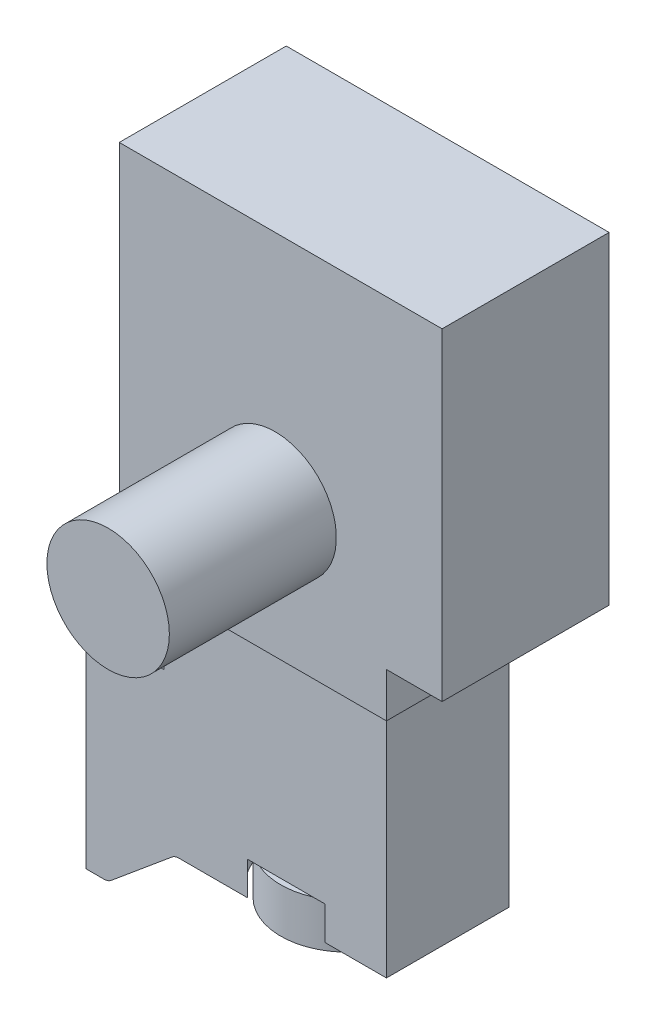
from build123d import *

# Parameters (mm, degrees)
BASE_EXTRUSION_DEPTH    = 5.5
ESQUISSE2_W             = 20
ESQUISSE2_H             = 11
BOSS_EXTRU_1_DEPTH      = 8
ESQUISSE3_W             = 24
ESQUISSE3_H             = 15
BOSS_EXTRU_2_DEPTH      = 4
ESQUISSE4_W             = 29
ESQUISSE4_H             = 15
BOSS_EXTRU_3_DEPTH      = 29
ESQUISSE5_R             = 5.5
BOSS_EXTRU_4_DEPTH      = 15
ESQUISSE6_R             = 6.5
ENL_V_MAT_EXTRU_1_DEPTH = 3
ESQUISSE7_R             = 6
BOSS_EXTRU_5_DEPTH      = 4


with BuildPart() as part:
    # Esquisse1 → Base-Extrusion (new, symmetric)
    with BuildSketch(Plane.XY):
        with BuildLine():
            Line((2.278134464, 0.23177872), (7.721865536, 4.76822128))
            ThreePointArc((7.721865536, 4.76822128), (8.021624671, 4.940271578), (8.362049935, 5))
            Line((8.362049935, 5), (27, 5))
            Line((27, 5), (27, 19))
            Line((27, 19), (0, 19))
            Line((0, 19), (0, 0))
            Line((0, 0), (1.637950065, 0))
            ThreePointArc((1.637950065, 0), (1.978375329, 0.059728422), (2.278134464, 0.23177872))
        make_face()
    extrude(amount=BASE_EXTRUSION_DEPTH, both=True)

    # Esquisse2 → Boss.-Extru.1 (add)
    with BuildSketch(Plane(origin=(0, 19, 0), x_dir=(-1, 0, 0), z_dir=(0, 1, 0))):
        with Locations((-17, 0)):
            Rectangle(ESQUISSE2_W, ESQUISSE2_H)
    extrude(amount=BOSS_EXTRU_1_DEPTH)

    # Esquisse3 → Boss.-Extru.2 (add)
    with BuildSketch(Plane(origin=(0, 27, 0), x_dir=(-1, 0, 0), z_dir=(0, 1, 0))):
        with Locations((-17, 0)):
            Rectangle(ESQUISSE3_W, ESQUISSE3_H)
    extrude(amount=BOSS_EXTRU_2_DEPTH)

    # Esquisse4 → Boss.-Extru.3 (add)
    with BuildSketch(Plane(origin=(0, 31, 0), x_dir=(-1, 0, 0), z_dir=(0, 1, 0))):
        with Locations((-19.5, 0)):
            Rectangle(ESQUISSE4_W, ESQUISSE4_H)
    extrude(amount=BOSS_EXTRU_3_DEPTH)

    # Esquisse5 → Boss.-Extru.4 (add)
    with BuildSketch(Plane.XY.offset(7.5)):
        with Locations(Location((19, 39, 0), (0, 0, 180))):
            Circle(ESQUISSE5_R)
    extrude(amount=BOSS_EXTRU_4_DEPTH)

    # Esquisse6 → Enl_v. mat.-Extru.1 (cut)
    with BuildSketch(Plane.XZ.offset(-5)):
        with Locations((18, 0)):
            Circle(ESQUISSE6_R)
    extrude(amount=-ENL_V_MAT_EXTRU_1_DEPTH, mode=Mode.SUBTRACT)

    # Esquisse7 → Boss.-Extru.5 (add)
    with BuildSketch(Plane.XZ.offset(-8)):
        with Locations(Location((18, 0, 0), (0, 0, 113.556464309))):
            Circle(ESQUISSE7_R)
    extrude(amount=BOSS_EXTRU_5_DEPTH)


solid = part.part
